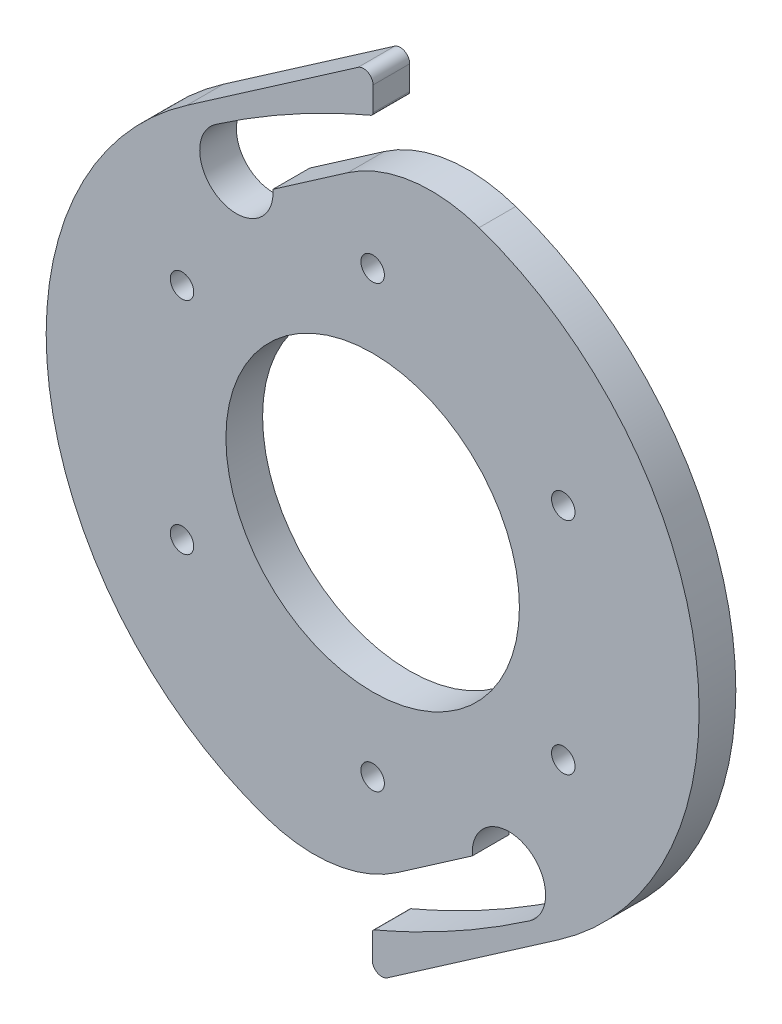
ISO-10303-21;
HEADER;
FILE_DESCRIPTION(('STEP AP214'),'2;1');
FILE_NAME('part.step','',(''),(''),'','','');
FILE_SCHEMA(('AUTOMOTIVE_DESIGN { 1 0 10303 214 1 1 1 1 }'));
ENDSEC;
DATA;
#1=APPLICATION_CONTEXT('core data for automotive mechanical design processes');
#2=APPLICATION_PROTOCOL_DEFINITION('international standard','automotive_design',2000,#1);
#3=PRODUCT_CONTEXT('',#1,'mechanical');
#4=PRODUCT('Part','Part','',(#3));
#5=PRODUCT_RELATED_PRODUCT_CATEGORY('part','',(#4));
#6=PRODUCT_DEFINITION_FORMATION('','',#4);
#7=PRODUCT_DEFINITION_CONTEXT('part definition',#1,'design');
#8=PRODUCT_DEFINITION('design','',#6,#7);
#9=PRODUCT_DEFINITION_SHAPE('','',#8);
#10=(LENGTH_UNIT() NAMED_UNIT(*) SI_UNIT(.MILLI.,.METRE.));
#11=(NAMED_UNIT(*) PLANE_ANGLE_UNIT() SI_UNIT($,.RADIAN.));
#12=(NAMED_UNIT(*) SI_UNIT($,.STERADIAN.) SOLID_ANGLE_UNIT());
#13=UNCERTAINTY_MEASURE_WITH_UNIT(LENGTH_MEASURE(1.E-05),#10,'distance_accuracy_value','');
#14=(GEOMETRIC_REPRESENTATION_CONTEXT(3) GLOBAL_UNCERTAINTY_ASSIGNED_CONTEXT((#13)) GLOBAL_UNIT_ASSIGNED_CONTEXT((#10,
#11,#12)) REPRESENTATION_CONTEXT('',''));
#15=CARTESIAN_POINT('',(0.,0.,0.));
#16=DIRECTION('',(0.,0.,1.));
#17=DIRECTION('',(1.,0.,0.));
#18=AXIS2_PLACEMENT_3D('',#15,#16,#17);
#19=CARTESIAN_POINT('',(-0.449022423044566,48.4008289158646,5.));
#20=DIRECTION('',(0.,0.,-1.));
#21=DIRECTION('',(-1.,0.,0.));
#22=AXIS2_PLACEMENT_3D('',#19,#20,#21);
#23=PLANE('',#22);
#24=CARTESIAN_POINT('',(-25.9807621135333,-14.9999999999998,5.));
#25=DIRECTION('',(0.,0.,1.));
#26=DIRECTION('',(1.,0.,0.));
#27=AXIS2_PLACEMENT_3D('',#24,#25,#26);
#28=CIRCLE('',#27,1.6);
#29=CARTESIAN_POINT('',(-24.3807621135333,-14.9999999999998,5.));
#30=VERTEX_POINT('',#29);
#31=EDGE_CURVE('E350',#30,#30,#28,.T.);
#32=ORIENTED_EDGE('',*,*,#31,.F.);
#33=EDGE_LOOP('',(#32));
#34=FACE_BOUND('',#33,.T.);
#35=CARTESIAN_POINT('',(25.9807621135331,-15.0000000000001,5.));
#36=DIRECTION('',(0.,0.,1.));
#37=DIRECTION('',(1.,0.,0.));
#38=AXIS2_PLACEMENT_3D('',#35,#36,#37);
#39=CIRCLE('',#38,1.6);
#40=CARTESIAN_POINT('',(27.5807621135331,-15.0000000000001,5.));
#41=VERTEX_POINT('',#40);
#42=EDGE_CURVE('E362',#41,#41,#39,.T.);
#43=ORIENTED_EDGE('',*,*,#42,.F.);
#44=EDGE_LOOP('',(#43));
#45=FACE_BOUND('',#44,.T.);
#46=CARTESIAN_POINT('',(0.,30.,5.));
#47=DIRECTION('',(0.,0.,1.));
#48=DIRECTION('',(1.,0.,0.));
#49=AXIS2_PLACEMENT_3D('',#46,#47,#48);
#50=CIRCLE('',#49,1.6);
#51=CARTESIAN_POINT('',(1.6,30.,5.));
#52=VERTEX_POINT('',#51);
#53=EDGE_CURVE('E374',#52,#52,#50,.T.);
#54=ORIENTED_EDGE('',*,*,#53,.F.);
#55=EDGE_LOOP('',(#54));
#56=FACE_BOUND('',#55,.T.);
#57=CARTESIAN_POINT('',(-0.449022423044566,48.4008289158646,5.));
#58=DIRECTION('',(0.,0.,-1.));
#59=DIRECTION('',(-1.,0.,0.));
#60=AXIS2_PLACEMENT_3D('',#57,#58,#59);
#61=CIRCLE('',#60,0.499999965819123);
#62=CARTESIAN_POINT('',(0.0509775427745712,48.4008289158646,5.));
#63=VERTEX_POINT('',#62);
#64=CARTESIAN_POINT('',(-0.25283719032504,47.9409253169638,5.));
#65=VERTEX_POINT('',#64);
#66=EDGE_CURVE('E251',#63,#65,#61,.T.);
#67=ORIENTED_EDGE('',*,*,#66,.F.);
#68=DIRECTION('',(0.,-1.,0.));
#69=VECTOR('',#68,1.);
#70=CARTESIAN_POINT('',(0.0509775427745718,51.670234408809,5.));
#71=LINE('',#70,#69);
#72=CARTESIAN_POINT('',(0.0509775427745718,51.670234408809,5.));
#73=VERTEX_POINT('',#72);
#74=EDGE_CURVE('E175',#73,#63,#71,.T.);
#75=ORIENTED_EDGE('',*,*,#74,.F.);
#76=CARTESIAN_POINT('',(-1.24902245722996,51.6702344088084,5.));
#77=DIRECTION('',(0.,0.,1.));
#78=DIRECTION('',(1.,0.,0.));
#79=AXIS2_PLACEMENT_3D('',#76,#77,#78);
#80=CIRCLE('',#79,1.30000000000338);
#81=CARTESIAN_POINT('',(-1.98902706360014,52.739062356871,5.));
#82=VERTEX_POINT('',#81);
#83=EDGE_CURVE('E170',#73,#82,#80,.T.);
#84=ORIENTED_EDGE('',*,*,#83,.T.);
#85=DIRECTION('',(0.822175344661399,0.569234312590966,0.));
#86=VECTOR('',#85,1.);
#87=CARTESIAN_POINT('',(-25.3269304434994,36.5810305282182,5.));
#88=LINE('',#87,#86);
#89=CARTESIAN_POINT('',(-25.3269304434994,36.5810305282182,5.));
#90=VERTEX_POINT('',#89);
#91=EDGE_CURVE('E174',#90,#82,#88,.T.);
#92=ORIENTED_EDGE('',*,*,#91,.F.);
#93=CARTESIAN_POINT('',(0.,0.,5.));
#94=DIRECTION('',(0.,0.,1.));
#95=DIRECTION('',(1.,0.,0.));
#96=AXIS2_PLACEMENT_3D('',#93,#94,#95);
#97=CIRCLE('',#96,44.4929792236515);
#98=CARTESIAN_POINT('',(-14.5031246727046,-42.0628645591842,5.));
#99=VERTEX_POINT('',#98);
#100=EDGE_CURVE('E187',#90,#99,#97,.T.);
#101=ORIENTED_EDGE('',*,*,#100,.T.);
#102=CARTESIAN_POINT('',(-7.98383784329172,-23.1552232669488,5.));
#103=DIRECTION('',(0.,0.,1.));
#104=DIRECTION('',(1.,0.,0.));
#105=AXIS2_PLACEMENT_3D('',#102,#103,#104);
#106=CIRCLE('',#105,20.);
#107=CARTESIAN_POINT('',(3.40084840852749,-39.5987301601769,5.));
#108=VERTEX_POINT('',#107);
#109=EDGE_CURVE('E189',#99,#108,#106,.T.);
#110=ORIENTED_EDGE('',*,*,#109,.T.);
#111=DIRECTION('',(0.822175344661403,0.56923431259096,0.));
#112=VECTOR('',#111,1.);
#113=CARTESIAN_POINT('',(3.4008484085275,-39.5987301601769,5.));
#114=LINE('',#113,#112);
#115=CARTESIAN_POINT('',(13.5809367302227,-32.5505309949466,5.));
#116=VERTEX_POINT('',#115);
#117=EDGE_CURVE('E449',#108,#116,#114,.T.);
#118=ORIENTED_EDGE('',*,*,#117,.T.);
#119=CARTESIAN_POINT('',(18.5670774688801,-32.1785087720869,5.));
#120=DIRECTION('',(0.,0.,1.));
#121=DIRECTION('',(1.,0.,0.));
#122=AXIS2_PLACEMENT_3D('',#119,#120,#121);
#123=CIRCLE('',#122,5.);
#124=CARTESIAN_POINT('',(21.4132490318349,-36.289385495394,5.));
#125=VERTEX_POINT('',#124);
#126=EDGE_CURVE('E441',#125,#116,#123,.T.);
#127=ORIENTED_EDGE('',*,*,#126,.F.);
#128=CARTESIAN_POINT('',(21.4132490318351,-36.2893854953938,5.));
#129=CARTESIAN_POINT('',(14.7027815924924,-40.9018978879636,5.));
#130=CARTESIAN_POINT('',(7.64931093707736,-44.7857446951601,5.));
#131=CARTESIAN_POINT('',(0.252837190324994,-47.9409253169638,5.));
#132=B_SPLINE_CURVE_WITH_KNOTS('',3,(#128,#129,#130,#131),.UNSPECIFIED.,.F.,.F.,(4,4),(0.,
0.807146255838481),.UNSPECIFIED.);
#133=CARTESIAN_POINT('',(0.252837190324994,-47.9409253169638,5.));
#134=VERTEX_POINT('',#133);
#135=EDGE_CURVE('E435',#125,#134,#132,.T.);
#136=ORIENTED_EDGE('',*,*,#135,.T.);
#137=CARTESIAN_POINT('',(0.449022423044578,-48.4008289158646,5.));
#138=DIRECTION('',(0.,0.,-1.));
#139=DIRECTION('',(-1.,0.,0.));
#140=AXIS2_PLACEMENT_3D('',#137,#138,#139);
#141=CIRCLE('',#140,0.499999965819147);
#142=CARTESIAN_POINT('',(-0.0509775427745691,-48.4008289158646,5.));
#143=VERTEX_POINT('',#142);
#144=EDGE_CURVE('E442',#143,#134,#141,.T.);
#145=ORIENTED_EDGE('',*,*,#144,.F.);
#146=DIRECTION('',(1.0677768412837E-13,1.,0.));
#147=VECTOR('',#146,1.);
#148=CARTESIAN_POINT('',(-0.0509775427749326,-51.670234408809,5.));
#149=LINE('',#148,#147);
#150=CARTESIAN_POINT('',(-0.0509775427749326,-51.670234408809,5.));
#151=VERTEX_POINT('',#150);
#152=EDGE_CURVE('E472',#151,#143,#149,.T.);
#153=ORIENTED_EDGE('',*,*,#152,.F.);
#154=CARTESIAN_POINT('',(1.2490224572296,-51.6702344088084,5.));
#155=DIRECTION('',(0.,0.,1.));
#156=DIRECTION('',(1.,0.,0.));
#157=AXIS2_PLACEMENT_3D('',#154,#155,#156);
#158=CIRCLE('',#157,1.30000000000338);
#159=CARTESIAN_POINT('',(1.98902706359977,-52.739062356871,5.));
#160=VERTEX_POINT('',#159);
#161=EDGE_CURVE('E473',#151,#160,#158,.T.);
#162=ORIENTED_EDGE('',*,*,#161,.T.);
#163=DIRECTION('',(-0.822175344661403,-0.56923431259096,0.));
#164=VECTOR('',#163,1.);
#165=CARTESIAN_POINT('',(25.3269304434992,-36.5810305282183,5.));
#166=LINE('',#165,#164);
#167=CARTESIAN_POINT('',(25.3269304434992,-36.5810305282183,5.));
#168=VERTEX_POINT('',#167);
#169=EDGE_CURVE('E474',#168,#160,#166,.T.);
#170=ORIENTED_EDGE('',*,*,#169,.F.);
#171=CARTESIAN_POINT('',(0.,0.,5.));
#172=DIRECTION('',(0.,0.,1.));
#173=DIRECTION('',(1.,0.,0.));
#174=AXIS2_PLACEMENT_3D('',#171,#172,#173);
#175=CIRCLE('',#174,44.4929792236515);
#176=CARTESIAN_POINT('',(14.5031246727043,42.0628645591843,5.));
#177=VERTEX_POINT('',#176);
#178=EDGE_CURVE('E479',#168,#177,#175,.T.);
#179=ORIENTED_EDGE('',*,*,#178,.T.);
#180=CARTESIAN_POINT('',(7.98383784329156,23.1552232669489,5.));
#181=DIRECTION('',(0.,0.,1.));
#182=DIRECTION('',(1.,0.,0.));
#183=AXIS2_PLACEMENT_3D('',#180,#181,#182);
#184=CIRCLE('',#183,20.);
#185=CARTESIAN_POINT('',(-3.40084840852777,39.5987301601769,5.));
#186=VERTEX_POINT('',#185);
#187=EDGE_CURVE('E481',#177,#186,#184,.T.);
#188=ORIENTED_EDGE('',*,*,#187,.T.);
#189=DIRECTION('',(-0.822175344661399,-0.569234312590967,0.));
#190=VECTOR('',#189,1.);
#191=CARTESIAN_POINT('',(-3.40084840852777,39.5987301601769,5.));
#192=LINE('',#191,#190);
#193=CARTESIAN_POINT('',(-13.5809367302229,32.5505309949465,5.));
#194=VERTEX_POINT('',#193);
#195=EDGE_CURVE('E482',#186,#194,#192,.T.);
#196=ORIENTED_EDGE('',*,*,#195,.T.);
#197=CARTESIAN_POINT('',(-18.5670774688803,32.1785087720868,5.));
#198=DIRECTION('',(0.,0.,1.));
#199=DIRECTION('',(1.,0.,0.));
#200=AXIS2_PLACEMENT_3D('',#197,#198,#199);
#201=CIRCLE('',#200,5.);
#202=CARTESIAN_POINT('',(-21.4132490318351,36.2893854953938,5.));
#203=VERTEX_POINT('',#202);
#204=EDGE_CURVE('E389',#203,#194,#201,.T.);
#205=ORIENTED_EDGE('',*,*,#204,.F.);
#206=CARTESIAN_POINT('',(-21.4132490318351,36.2893854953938,5.));
#207=CARTESIAN_POINT('',(-14.7027815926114,40.9018978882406,5.));
#208=CARTESIAN_POINT('',(-7.64931093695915,44.7857446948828,5.));
#209=CARTESIAN_POINT('',(-0.25283719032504,47.9409253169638,5.));
#210=B_SPLINE_CURVE_WITH_KNOTS('',3,(#206,#207,#208,#209),.UNSPECIFIED.,.F.,.F.,(4,4),(0.,
0.807146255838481),.UNSPECIFIED.);
#211=EDGE_CURVE('E124',#203,#65,#210,.T.);
#212=ORIENTED_EDGE('',*,*,#211,.T.);
#213=EDGE_LOOP('',(#67,#75,#84,#92,#101,#110,#118,#127,#136,#145,#153,#162,#170,#179,#188,#196,
#205,#212));
#214=FACE_BOUND('',#213,.T.);
#215=CARTESIAN_POINT('',(0.,0.,5.));
#216=DIRECTION('',(0.,0.,1.));
#217=DIRECTION('',(1.,0.,0.));
#218=AXIS2_PLACEMENT_3D('',#215,#216,#217);
#219=CIRCLE('',#218,20.);
#220=CARTESIAN_POINT('',(20.,0.,5.));
#221=VERTEX_POINT('',#220);
#222=EDGE_CURVE('E198',#221,#221,#219,.T.);
#223=ORIENTED_EDGE('',*,*,#222,.F.);
#224=EDGE_LOOP('',(#223));
#225=FACE_BOUND('',#224,.T.);
#226=CARTESIAN_POINT('',(25.9807621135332,14.9999999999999,5.));
#227=DIRECTION('',(0.,0.,1.));
#228=DIRECTION('',(1.,0.,0.));
#229=AXIS2_PLACEMENT_3D('',#226,#227,#228);
#230=CIRCLE('',#229,1.6);
#231=CARTESIAN_POINT('',(27.5807621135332,14.9999999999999,5.));
#232=VERTEX_POINT('',#231);
#233=EDGE_CURVE('E368',#232,#232,#230,.T.);
#234=ORIENTED_EDGE('',*,*,#233,.F.);
#235=EDGE_LOOP('',(#234));
#236=FACE_BOUND('',#235,.T.);
#237=CARTESIAN_POINT('',(-2.09489001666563E-13,-30.,5.));
#238=DIRECTION('',(0.,0.,1.));
#239=DIRECTION('',(1.,0.,0.));
#240=AXIS2_PLACEMENT_3D('',#237,#238,#239);
#241=CIRCLE('',#240,1.6);
#242=CARTESIAN_POINT('',(1.59999999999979,-30.,5.));
#243=VERTEX_POINT('',#242);
#244=EDGE_CURVE('E356',#243,#243,#241,.T.);
#245=ORIENTED_EDGE('',*,*,#244,.F.);
#246=EDGE_LOOP('',(#245));
#247=FACE_BOUND('',#246,.T.);
#248=CARTESIAN_POINT('',(-25.980762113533,15.0000000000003,5.));
#249=DIRECTION('',(0.,0.,1.));
#250=DIRECTION('',(1.,0.,0.));
#251=AXIS2_PLACEMENT_3D('',#248,#249,#250);
#252=CIRCLE('',#251,1.6);
#253=CARTESIAN_POINT('',(-24.380762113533,15.0000000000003,5.));
#254=VERTEX_POINT('',#253);
#255=EDGE_CURVE('E341',#254,#254,#252,.T.);
#256=ORIENTED_EDGE('',*,*,#255,.F.);
#257=EDGE_LOOP('',(#256));
#258=FACE_BOUND('',#257,.T.);
#259=ADVANCED_FACE('F37',(#34,#45,#56,#214,#225,#236,#247,#258),#23,.F.);
#260=CARTESIAN_POINT('',(-0.449022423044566,48.4008289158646,0.));
#261=DIRECTION('',(0.,0.,-1.));
#262=DIRECTION('',(-1.,0.,0.));
#263=AXIS2_PLACEMENT_3D('',#260,#261,#262);
#264=PLANE('',#263);
#265=CARTESIAN_POINT('',(-25.9807621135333,-14.9999999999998,0.));
#266=DIRECTION('',(0.,0.,1.));
#267=DIRECTION('',(1.,0.,0.));
#268=AXIS2_PLACEMENT_3D('',#265,#266,#267);
#269=CIRCLE('',#268,1.6);
#270=CARTESIAN_POINT('',(-24.3807621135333,-14.9999999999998,0.));
#271=VERTEX_POINT('',#270);
#272=EDGE_CURVE('E347',#271,#271,#269,.T.);
#273=ORIENTED_EDGE('',*,*,#272,.T.);
#274=EDGE_LOOP('',(#273));
#275=FACE_BOUND('',#274,.T.);
#276=CARTESIAN_POINT('',(25.9807621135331,-15.0000000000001,0.));
#277=DIRECTION('',(0.,0.,1.));
#278=DIRECTION('',(1.,0.,0.));
#279=AXIS2_PLACEMENT_3D('',#276,#277,#278);
#280=CIRCLE('',#279,1.6);
#281=CARTESIAN_POINT('',(27.5807621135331,-15.0000000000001,0.));
#282=VERTEX_POINT('',#281);
#283=EDGE_CURVE('E359',#282,#282,#280,.T.);
#284=ORIENTED_EDGE('',*,*,#283,.T.);
#285=EDGE_LOOP('',(#284));
#286=FACE_BOUND('',#285,.T.);
#287=CARTESIAN_POINT('',(0.,30.,0.));
#288=DIRECTION('',(0.,0.,1.));
#289=DIRECTION('',(1.,0.,0.));
#290=AXIS2_PLACEMENT_3D('',#287,#288,#289);
#291=CIRCLE('',#290,1.6);
#292=CARTESIAN_POINT('',(1.6,30.,0.));
#293=VERTEX_POINT('',#292);
#294=EDGE_CURVE('E371',#293,#293,#291,.T.);
#295=ORIENTED_EDGE('',*,*,#294,.T.);
#296=EDGE_LOOP('',(#295));
#297=FACE_BOUND('',#296,.T.);
#298=CARTESIAN_POINT('',(-0.449022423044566,48.4008289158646,0.));
#299=DIRECTION('',(0.,0.,-1.));
#300=DIRECTION('',(-1.,0.,0.));
#301=AXIS2_PLACEMENT_3D('',#298,#299,#300);
#302=CIRCLE('',#301,0.499999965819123);
#303=CARTESIAN_POINT('',(0.0509775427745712,48.4008289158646,0.));
#304=VERTEX_POINT('',#303);
#305=CARTESIAN_POINT('',(-0.25283719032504,47.9409253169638,0.));
#306=VERTEX_POINT('',#305);
#307=EDGE_CURVE('E194',#304,#306,#302,.T.);
#308=ORIENTED_EDGE('',*,*,#307,.T.);
#309=CARTESIAN_POINT('',(-21.4132490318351,36.2893854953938,0.));
#310=CARTESIAN_POINT('',(-14.7027815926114,40.9018978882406,0.));
#311=CARTESIAN_POINT('',(-7.64931093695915,44.7857446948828,0.));
#312=CARTESIAN_POINT('',(-0.25283719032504,47.9409253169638,0.));
#313=B_SPLINE_CURVE_WITH_KNOTS('',3,(#309,#310,#311,#312),.UNSPECIFIED.,.F.,.F.,(4,4),(0.,
0.807146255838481),.UNSPECIFIED.);
#314=CARTESIAN_POINT('',(-21.4132490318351,36.2893854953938,0.));
#315=VERTEX_POINT('',#314);
#316=EDGE_CURVE('E197',#315,#306,#313,.T.);
#317=ORIENTED_EDGE('',*,*,#316,.F.);
#318=CARTESIAN_POINT('',(-18.5670774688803,32.1785087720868,0.));
#319=DIRECTION('',(0.,0.,1.));
#320=DIRECTION('',(1.,0.,0.));
#321=AXIS2_PLACEMENT_3D('',#318,#319,#320);
#322=CIRCLE('',#321,5.);
#323=CARTESIAN_POINT('',(-13.5809367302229,32.5505309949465,0.));
#324=VERTEX_POINT('',#323);
#325=EDGE_CURVE('E203',#315,#324,#322,.T.);
#326=ORIENTED_EDGE('',*,*,#325,.T.);
#327=DIRECTION('',(-0.822175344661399,-0.569234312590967,0.));
#328=VECTOR('',#327,1.);
#329=CARTESIAN_POINT('',(-3.40084840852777,39.5987301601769,0.));
#330=LINE('',#329,#328);
#331=CARTESIAN_POINT('',(-3.40084840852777,39.5987301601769,0.));
#332=VERTEX_POINT('',#331);
#333=EDGE_CURVE('E209',#332,#324,#330,.T.);
#334=ORIENTED_EDGE('',*,*,#333,.F.);
#335=CARTESIAN_POINT('',(7.98383784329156,23.1552232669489,0.));
#336=DIRECTION('',(0.,0.,1.));
#337=DIRECTION('',(1.,0.,0.));
#338=AXIS2_PLACEMENT_3D('',#335,#336,#337);
#339=CIRCLE('',#338,20.);
#340=CARTESIAN_POINT('',(14.5031246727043,42.0628645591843,0.));
#341=VERTEX_POINT('',#340);
#342=EDGE_CURVE('E212',#341,#332,#339,.T.);
#343=ORIENTED_EDGE('',*,*,#342,.F.);
#344=CARTESIAN_POINT('',(0.,0.,0.));
#345=DIRECTION('',(0.,0.,1.));
#346=DIRECTION('',(1.,0.,0.));
#347=AXIS2_PLACEMENT_3D('',#344,#345,#346);
#348=CIRCLE('',#347,44.4929792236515);
#349=CARTESIAN_POINT('',(25.3269304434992,-36.5810305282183,0.));
#350=VERTEX_POINT('',#349);
#351=EDGE_CURVE('E214',#350,#341,#348,.T.);
#352=ORIENTED_EDGE('',*,*,#351,.F.);
#353=DIRECTION('',(-0.822175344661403,-0.56923431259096,0.));
#354=VECTOR('',#353,1.);
#355=CARTESIAN_POINT('',(25.3269304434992,-36.5810305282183,0.));
#356=LINE('',#355,#354);
#357=CARTESIAN_POINT('',(1.98902706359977,-52.739062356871,0.));
#358=VERTEX_POINT('',#357);
#359=EDGE_CURVE('E216',#350,#358,#356,.T.);
#360=ORIENTED_EDGE('',*,*,#359,.T.);
#361=CARTESIAN_POINT('',(1.2490224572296,-51.6702344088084,0.));
#362=DIRECTION('',(0.,0.,1.));
#363=DIRECTION('',(1.,0.,0.));
#364=AXIS2_PLACEMENT_3D('',#361,#362,#363);
#365=CIRCLE('',#364,1.30000000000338);
#366=CARTESIAN_POINT('',(-0.0509775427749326,-51.670234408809,0.));
#367=VERTEX_POINT('',#366);
#368=EDGE_CURVE('E219',#367,#358,#365,.T.);
#369=ORIENTED_EDGE('',*,*,#368,.F.);
#370=DIRECTION('',(1.0677768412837E-13,1.,0.));
#371=VECTOR('',#370,1.);
#372=CARTESIAN_POINT('',(-0.0509775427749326,-51.670234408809,0.));
#373=LINE('',#372,#371);
#374=CARTESIAN_POINT('',(-0.0509775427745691,-48.4008289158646,0.));
#375=VERTEX_POINT('',#374);
#376=EDGE_CURVE('E222',#367,#375,#373,.T.);
#377=ORIENTED_EDGE('',*,*,#376,.T.);
#378=CARTESIAN_POINT('',(0.449022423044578,-48.4008289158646,0.));
#379=DIRECTION('',(0.,0.,-1.));
#380=DIRECTION('',(-1.,0.,0.));
#381=AXIS2_PLACEMENT_3D('',#378,#379,#380);
#382=CIRCLE('',#381,0.499999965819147);
#383=CARTESIAN_POINT('',(0.252837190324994,-47.9409253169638,0.));
#384=VERTEX_POINT('',#383);
#385=EDGE_CURVE('E225',#375,#384,#382,.T.);
#386=ORIENTED_EDGE('',*,*,#385,.T.);
#387=CARTESIAN_POINT('',(21.4132490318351,-36.2893854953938,0.));
#388=CARTESIAN_POINT('',(14.7027815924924,-40.9018978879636,0.));
#389=CARTESIAN_POINT('',(7.64931093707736,-44.7857446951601,0.));
#390=CARTESIAN_POINT('',(0.252837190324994,-47.9409253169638,0.));
#391=B_SPLINE_CURVE_WITH_KNOTS('',3,(#387,#388,#389,#390),.UNSPECIFIED.,.F.,.F.,(4,4),(0.,
0.807146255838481),.UNSPECIFIED.);
#392=CARTESIAN_POINT('',(21.4132490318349,-36.289385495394,0.));
#393=VERTEX_POINT('',#392);
#394=EDGE_CURVE('E228',#393,#384,#391,.T.);
#395=ORIENTED_EDGE('',*,*,#394,.F.);
#396=CARTESIAN_POINT('',(18.5670774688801,-32.1785087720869,0.));
#397=DIRECTION('',(0.,0.,1.));
#398=DIRECTION('',(1.,0.,0.));
#399=AXIS2_PLACEMENT_3D('',#396,#397,#398);
#400=CIRCLE('',#399,5.);
#401=CARTESIAN_POINT('',(13.5809367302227,-32.5505309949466,0.));
#402=VERTEX_POINT('',#401);
#403=EDGE_CURVE('E233',#393,#402,#400,.T.);
#404=ORIENTED_EDGE('',*,*,#403,.T.);
#405=DIRECTION('',(0.822175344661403,0.56923431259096,0.));
#406=VECTOR('',#405,1.);
#407=CARTESIAN_POINT('',(3.4008484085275,-39.5987301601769,0.));
#408=LINE('',#407,#406);
#409=CARTESIAN_POINT('',(3.40084840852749,-39.5987301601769,0.));
#410=VERTEX_POINT('',#409);
#411=EDGE_CURVE('E239',#410,#402,#408,.T.);
#412=ORIENTED_EDGE('',*,*,#411,.F.);
#413=CARTESIAN_POINT('',(-7.98383784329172,-23.1552232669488,0.));
#414=DIRECTION('',(0.,0.,1.));
#415=DIRECTION('',(1.,0.,0.));
#416=AXIS2_PLACEMENT_3D('',#413,#414,#415);
#417=CIRCLE('',#416,20.);
#418=CARTESIAN_POINT('',(-14.5031246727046,-42.0628645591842,0.));
#419=VERTEX_POINT('',#418);
#420=EDGE_CURVE('E242',#419,#410,#417,.T.);
#421=ORIENTED_EDGE('',*,*,#420,.F.);
#422=CARTESIAN_POINT('',(0.,0.,0.));
#423=DIRECTION('',(0.,0.,1.));
#424=DIRECTION('',(1.,0.,0.));
#425=AXIS2_PLACEMENT_3D('',#422,#423,#424);
#426=CIRCLE('',#425,44.4929792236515);
#427=CARTESIAN_POINT('',(-25.3269304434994,36.5810305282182,0.));
#428=VERTEX_POINT('',#427);
#429=EDGE_CURVE('E244',#428,#419,#426,.T.);
#430=ORIENTED_EDGE('',*,*,#429,.F.);
#431=DIRECTION('',(0.822175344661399,0.569234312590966,0.));
#432=VECTOR('',#431,1.);
#433=CARTESIAN_POINT('',(-25.3269304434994,36.5810305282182,0.));
#434=LINE('',#433,#432);
#435=CARTESIAN_POINT('',(-1.98902706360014,52.739062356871,0.));
#436=VERTEX_POINT('',#435);
#437=EDGE_CURVE('E246',#428,#436,#434,.T.);
#438=ORIENTED_EDGE('',*,*,#437,.T.);
#439=CARTESIAN_POINT('',(-1.24902245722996,51.6702344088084,0.));
#440=DIRECTION('',(0.,0.,1.));
#441=DIRECTION('',(1.,0.,0.));
#442=AXIS2_PLACEMENT_3D('',#439,#440,#441);
#443=CIRCLE('',#442,1.30000000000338);
#444=CARTESIAN_POINT('',(0.0509775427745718,51.670234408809,0.));
#445=VERTEX_POINT('',#444);
#446=EDGE_CURVE('E179',#445,#436,#443,.T.);
#447=ORIENTED_EDGE('',*,*,#446,.F.);
#448=DIRECTION('',(0.,-1.,0.));
#449=VECTOR('',#448,1.);
#450=CARTESIAN_POINT('',(0.0509775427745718,51.670234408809,0.));
#451=LINE('',#450,#449);
#452=EDGE_CURVE('E249',#445,#304,#451,.T.);
#453=ORIENTED_EDGE('',*,*,#452,.T.);
#454=EDGE_LOOP('',(#308,#317,#326,#334,#343,#352,#360,#369,#377,#386,#395,#404,#412,#421,#430,
#438,#447,#453));
#455=FACE_BOUND('',#454,.T.);
#456=CARTESIAN_POINT('',(0.,0.,0.));
#457=DIRECTION('',(0.,0.,1.));
#458=DIRECTION('',(1.,0.,0.));
#459=AXIS2_PLACEMENT_3D('',#456,#457,#458);
#460=CIRCLE('',#459,20.);
#461=CARTESIAN_POINT('',(20.,0.,0.));
#462=VERTEX_POINT('',#461);
#463=EDGE_CURVE('E377',#462,#462,#460,.T.);
#464=ORIENTED_EDGE('',*,*,#463,.T.);
#465=EDGE_LOOP('',(#464));
#466=FACE_BOUND('',#465,.T.);
#467=CARTESIAN_POINT('',(25.9807621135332,14.9999999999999,0.));
#468=DIRECTION('',(0.,0.,1.));
#469=DIRECTION('',(1.,0.,0.));
#470=AXIS2_PLACEMENT_3D('',#467,#468,#469);
#471=CIRCLE('',#470,1.6);
#472=CARTESIAN_POINT('',(27.5807621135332,14.9999999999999,0.));
#473=VERTEX_POINT('',#472);
#474=EDGE_CURVE('E365',#473,#473,#471,.T.);
#475=ORIENTED_EDGE('',*,*,#474,.T.);
#476=EDGE_LOOP('',(#475));
#477=FACE_BOUND('',#476,.T.);
#478=CARTESIAN_POINT('',(-2.09489001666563E-13,-30.,0.));
#479=DIRECTION('',(0.,0.,1.));
#480=DIRECTION('',(1.,0.,0.));
#481=AXIS2_PLACEMENT_3D('',#478,#479,#480);
#482=CIRCLE('',#481,1.6);
#483=CARTESIAN_POINT('',(1.59999999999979,-30.,0.));
#484=VERTEX_POINT('',#483);
#485=EDGE_CURVE('E353',#484,#484,#482,.T.);
#486=ORIENTED_EDGE('',*,*,#485,.T.);
#487=EDGE_LOOP('',(#486));
#488=FACE_BOUND('',#487,.T.);
#489=CARTESIAN_POINT('',(-25.980762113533,15.0000000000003,0.));
#490=DIRECTION('',(0.,0.,1.));
#491=DIRECTION('',(1.,0.,0.));
#492=AXIS2_PLACEMENT_3D('',#489,#490,#491);
#493=CIRCLE('',#492,1.6);
#494=CARTESIAN_POINT('',(-24.380762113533,15.0000000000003,0.));
#495=VERTEX_POINT('',#494);
#496=EDGE_CURVE('E344',#495,#495,#493,.T.);
#497=ORIENTED_EDGE('',*,*,#496,.T.);
#498=EDGE_LOOP('',(#497));
#499=FACE_BOUND('',#498,.T.);
#500=ADVANCED_FACE('F288',(#275,#286,#297,#455,#466,#477,#488,#499),#264,.T.);
#501=CARTESIAN_POINT('',(-0.449022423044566,48.4008289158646,5.));
#502=DIRECTION('',(0.,0.,-1.));
#503=DIRECTION('',(-1.,0.,0.));
#504=AXIS2_PLACEMENT_3D('',#501,#502,#503);
#505=CYLINDRICAL_SURFACE('',#504,0.499999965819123);
#506=ORIENTED_EDGE('',*,*,#307,.F.);
#507=DIRECTION('',(0.,0.,-1.));
#508=VECTOR('',#507,1.);
#509=CARTESIAN_POINT('',(0.0509775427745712,48.4008289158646,5.));
#510=LINE('',#509,#508);
#511=EDGE_CURVE('E11',#63,#304,#510,.T.);
#512=ORIENTED_EDGE('',*,*,#511,.F.);
#513=ORIENTED_EDGE('',*,*,#66,.T.);
#514=DIRECTION('',(0.,0.,-1.));
#515=VECTOR('',#514,1.);
#516=CARTESIAN_POINT('',(-0.25283719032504,47.9409253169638,5.));
#517=LINE('',#516,#515);
#518=EDGE_CURVE('E41',#65,#306,#517,.T.);
#519=ORIENTED_EDGE('',*,*,#518,.T.);
#520=EDGE_LOOP('',(#506,#512,#513,#519));
#521=FACE_BOUND('',#520,.T.);
#522=ADVANCED_FACE('F39',(#521),#505,.T.);
#523=CARTESIAN_POINT('',(0.0509775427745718,51.670234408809,5.));
#524=DIRECTION('',(1.,0.,0.));
#525=DIRECTION('',(0.,1.,0.));
#526=AXIS2_PLACEMENT_3D('',#523,#524,#525);
#527=PLANE('',#526);
#528=ORIENTED_EDGE('',*,*,#452,.F.);
#529=DIRECTION('',(0.,0.,-1.));
#530=VECTOR('',#529,1.);
#531=CARTESIAN_POINT('',(0.0509775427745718,51.670234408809,5.));
#532=LINE('',#531,#530);
#533=EDGE_CURVE('E47',#73,#445,#532,.T.);
#534=ORIENTED_EDGE('',*,*,#533,.F.);
#535=ORIENTED_EDGE('',*,*,#74,.T.);
#536=ORIENTED_EDGE('',*,*,#511,.T.);
#537=EDGE_LOOP('',(#528,#534,#535,#536));
#538=FACE_BOUND('',#537,.T.);
#539=ADVANCED_FACE('F290',(#538),#527,.T.);
#540=CARTESIAN_POINT('',(-1.24902245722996,51.6702344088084,5.));
#541=DIRECTION('',(0.,0.,-1.));
#542=DIRECTION('',(-1.,0.,0.));
#543=AXIS2_PLACEMENT_3D('',#540,#541,#542);
#544=CYLINDRICAL_SURFACE('',#543,1.30000000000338);
#545=ORIENTED_EDGE('',*,*,#446,.T.);
#546=DIRECTION('',(0.,0.,-1.));
#547=VECTOR('',#546,1.);
#548=CARTESIAN_POINT('',(-1.98902706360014,52.739062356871,5.));
#549=LINE('',#548,#547);
#550=EDGE_CURVE('E177',#82,#436,#549,.T.);
#551=ORIENTED_EDGE('',*,*,#550,.F.);
#552=ORIENTED_EDGE('',*,*,#83,.F.);
#553=ORIENTED_EDGE('',*,*,#533,.T.);
#554=EDGE_LOOP('',(#545,#551,#552,#553));
#555=FACE_BOUND('',#554,.T.);
#556=ADVANCED_FACE('F178',(#555),#544,.T.);
#557=CARTESIAN_POINT('',(-25.3269304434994,36.5810305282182,5.));
#558=DIRECTION('',(-0.569234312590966,0.822175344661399,0.));
#559=DIRECTION('',(-0.822175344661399,-0.569234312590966,0.));
#560=AXIS2_PLACEMENT_3D('',#557,#558,#559);
#561=PLANE('',#560);
#562=ORIENTED_EDGE('',*,*,#437,.F.);
#563=DIRECTION('',(0.,0.,-1.));
#564=VECTOR('',#563,1.);
#565=CARTESIAN_POINT('',(-25.3269304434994,36.5810305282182,5.));
#566=LINE('',#565,#564);
#567=EDGE_CURVE('E183',#90,#428,#566,.T.);
#568=ORIENTED_EDGE('',*,*,#567,.F.);
#569=ORIENTED_EDGE('',*,*,#91,.T.);
#570=ORIENTED_EDGE('',*,*,#550,.T.);
#571=EDGE_LOOP('',(#562,#568,#569,#570));
#572=FACE_BOUND('',#571,.T.);
#573=ADVANCED_FACE('F186',(#572),#561,.T.);
#574=CARTESIAN_POINT('',(0.,0.,5.));
#575=DIRECTION('',(0.,0.,-1.));
#576=DIRECTION('',(-1.,0.,0.));
#577=AXIS2_PLACEMENT_3D('',#574,#575,#576);
#578=CYLINDRICAL_SURFACE('',#577,44.4929792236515);
#579=ORIENTED_EDGE('',*,*,#429,.T.);
#580=DIRECTION('',(0.,0.,-1.));
#581=VECTOR('',#580,1.);
#582=CARTESIAN_POINT('',(-14.5031246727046,-42.0628645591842,5.));
#583=LINE('',#582,#581);
#584=EDGE_CURVE('E255',#99,#419,#583,.T.);
#585=ORIENTED_EDGE('',*,*,#584,.F.);
#586=ORIENTED_EDGE('',*,*,#100,.F.);
#587=ORIENTED_EDGE('',*,*,#567,.T.);
#588=EDGE_LOOP('',(#579,#585,#586,#587));
#589=FACE_BOUND('',#588,.T.);
#590=ADVANCED_FACE('F501',(#589),#578,.T.);
#591=CARTESIAN_POINT('',(-7.98383784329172,-23.1552232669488,5.));
#592=DIRECTION('',(0.,0.,-1.));
#593=DIRECTION('',(-1.,0.,0.));
#594=AXIS2_PLACEMENT_3D('',#591,#592,#593);
#595=CYLINDRICAL_SURFACE('',#594,20.);
#596=ORIENTED_EDGE('',*,*,#420,.T.);
#597=DIRECTION('',(0.,0.,-1.));
#598=VECTOR('',#597,1.);
#599=CARTESIAN_POINT('',(3.40084840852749,-39.5987301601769,5.));
#600=LINE('',#599,#598);
#601=EDGE_CURVE('E258',#108,#410,#600,.T.);
#602=ORIENTED_EDGE('',*,*,#601,.F.);
#603=ORIENTED_EDGE('',*,*,#109,.F.);
#604=ORIENTED_EDGE('',*,*,#584,.T.);
#605=EDGE_LOOP('',(#596,#602,#603,#604));
#606=FACE_BOUND('',#605,.T.);
#607=ADVANCED_FACE('F457',(#606),#595,.T.);
#608=CARTESIAN_POINT('',(3.4008484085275,-39.5987301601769,5.));
#609=DIRECTION('',(-0.56923431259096,0.822175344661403,0.));
#610=DIRECTION('',(-0.822175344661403,-0.56923431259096,0.));
#611=AXIS2_PLACEMENT_3D('',#608,#609,#610);
#612=PLANE('',#611);
#613=ORIENTED_EDGE('',*,*,#411,.T.);
#614=DIRECTION('',(0.,0.,-1.));
#615=VECTOR('',#614,1.);
#616=CARTESIAN_POINT('',(13.5809367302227,-32.5505309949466,5.));
#617=LINE('',#616,#615);
#618=EDGE_CURVE('E261',#116,#402,#617,.T.);
#619=ORIENTED_EDGE('',*,*,#618,.F.);
#620=ORIENTED_EDGE('',*,*,#117,.F.);
#621=ORIENTED_EDGE('',*,*,#601,.T.);
#622=EDGE_LOOP('',(#613,#619,#620,#621));
#623=FACE_BOUND('',#622,.T.);
#624=ADVANCED_FACE('F461',(#623),#612,.F.);
#625=CARTESIAN_POINT('',(18.5670774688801,-32.1785087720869,5.));
#626=DIRECTION('',(0.,0.,-1.));
#627=DIRECTION('',(-1.,0.,0.));
#628=AXIS2_PLACEMENT_3D('',#625,#626,#627);
#629=CYLINDRICAL_SURFACE('',#628,5.);
#630=ORIENTED_EDGE('',*,*,#403,.F.);
#631=DIRECTION('',(0.,0.,-1.));
#632=VECTOR('',#631,1.);
#633=CARTESIAN_POINT('',(21.4132490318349,-36.289385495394,5.));
#634=LINE('',#633,#632);
#635=EDGE_CURVE('E263',#125,#393,#634,.T.);
#636=ORIENTED_EDGE('',*,*,#635,.F.);
#637=ORIENTED_EDGE('',*,*,#126,.T.);
#638=ORIENTED_EDGE('',*,*,#618,.T.);
#639=EDGE_LOOP('',(#630,#636,#637,#638));
#640=FACE_BOUND('',#639,.T.);
#641=ADVANCED_FACE('F432',(#640),#629,.F.);
#642=DIRECTION('',(0.,0.,-1.));
#643=VECTOR('',#642,1.);
#644=SURFACE_OF_LINEAR_EXTRUSION('',#132,#643);
#645=ORIENTED_EDGE('',*,*,#394,.T.);
#646=DIRECTION('',(0.,0.,-1.));
#647=VECTOR('',#646,1.);
#648=CARTESIAN_POINT('',(0.252837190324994,-47.9409253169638,5.));
#649=LINE('',#648,#647);
#650=EDGE_CURVE('E265',#134,#384,#649,.T.);
#651=ORIENTED_EDGE('',*,*,#650,.F.);
#652=ORIENTED_EDGE('',*,*,#135,.F.);
#653=ORIENTED_EDGE('',*,*,#635,.T.);
#654=EDGE_LOOP('',(#645,#651,#652,#653));
#655=FACE_BOUND('',#654,.T.);
#656=ADVANCED_FACE('F427',(#655),#644,.F.);
#657=CARTESIAN_POINT('',(0.449022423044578,-48.4008289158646,5.));
#658=DIRECTION('',(0.,0.,-1.));
#659=DIRECTION('',(-1.,0.,0.));
#660=AXIS2_PLACEMENT_3D('',#657,#658,#659);
#661=CYLINDRICAL_SURFACE('',#660,0.499999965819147);
#662=ORIENTED_EDGE('',*,*,#385,.F.);
#663=DIRECTION('',(0.,0.,-1.));
#664=VECTOR('',#663,1.);
#665=CARTESIAN_POINT('',(-0.0509775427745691,-48.4008289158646,5.));
#666=LINE('',#665,#664);
#667=EDGE_CURVE('E267',#143,#375,#666,.T.);
#668=ORIENTED_EDGE('',*,*,#667,.F.);
#669=ORIENTED_EDGE('',*,*,#144,.T.);
#670=ORIENTED_EDGE('',*,*,#650,.T.);
#671=EDGE_LOOP('',(#662,#668,#669,#670));
#672=FACE_BOUND('',#671,.T.);
#673=ADVANCED_FACE('F423',(#672),#661,.T.);
#674=CARTESIAN_POINT('',(-0.0509775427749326,-51.670234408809,5.));
#675=DIRECTION('',(-1.,1.0677768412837E-13,0.));
#676=DIRECTION('',(-1.0677768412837E-13,-1.,0.));
#677=AXIS2_PLACEMENT_3D('',#674,#675,#676);
#678=PLANE('',#677);
#679=ORIENTED_EDGE('',*,*,#376,.F.);
#680=DIRECTION('',(0.,0.,-1.));
#681=VECTOR('',#680,1.);
#682=CARTESIAN_POINT('',(-0.0509775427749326,-51.670234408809,5.));
#683=LINE('',#682,#681);
#684=EDGE_CURVE('E269',#151,#367,#683,.T.);
#685=ORIENTED_EDGE('',*,*,#684,.F.);
#686=ORIENTED_EDGE('',*,*,#152,.T.);
#687=ORIENTED_EDGE('',*,*,#667,.T.);
#688=EDGE_LOOP('',(#679,#685,#686,#687));
#689=FACE_BOUND('',#688,.T.);
#690=ADVANCED_FACE('F419',(#689),#678,.T.);
#691=CARTESIAN_POINT('',(1.2490224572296,-51.6702344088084,5.));
#692=DIRECTION('',(0.,0.,-1.));
#693=DIRECTION('',(-1.,0.,0.));
#694=AXIS2_PLACEMENT_3D('',#691,#692,#693);
#695=CYLINDRICAL_SURFACE('',#694,1.30000000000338);
#696=ORIENTED_EDGE('',*,*,#368,.T.);
#697=DIRECTION('',(0.,0.,-1.));
#698=VECTOR('',#697,1.);
#699=CARTESIAN_POINT('',(1.98902706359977,-52.739062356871,5.));
#700=LINE('',#699,#698);
#701=EDGE_CURVE('E271',#160,#358,#700,.T.);
#702=ORIENTED_EDGE('',*,*,#701,.F.);
#703=ORIENTED_EDGE('',*,*,#161,.F.);
#704=ORIENTED_EDGE('',*,*,#684,.T.);
#705=EDGE_LOOP('',(#696,#702,#703,#704));
#706=FACE_BOUND('',#705,.T.);
#707=ADVANCED_FACE('F415',(#706),#695,.T.);
#708=CARTESIAN_POINT('',(25.3269304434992,-36.5810305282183,5.));
#709=DIRECTION('',(0.56923431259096,-0.822175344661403,0.));
#710=DIRECTION('',(0.822175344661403,0.56923431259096,0.));
#711=AXIS2_PLACEMENT_3D('',#708,#709,#710);
#712=PLANE('',#711);
#713=ORIENTED_EDGE('',*,*,#359,.F.);
#714=DIRECTION('',(0.,0.,-1.));
#715=VECTOR('',#714,1.);
#716=CARTESIAN_POINT('',(25.3269304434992,-36.5810305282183,5.));
#717=LINE('',#716,#715);
#718=EDGE_CURVE('E273',#168,#350,#717,.T.);
#719=ORIENTED_EDGE('',*,*,#718,.F.);
#720=ORIENTED_EDGE('',*,*,#169,.T.);
#721=ORIENTED_EDGE('',*,*,#701,.T.);
#722=EDGE_LOOP('',(#713,#719,#720,#721));
#723=FACE_BOUND('',#722,.T.);
#724=ADVANCED_FACE('F411',(#723),#712,.T.);
#725=CARTESIAN_POINT('',(0.,0.,5.));
#726=DIRECTION('',(0.,0.,-1.));
#727=DIRECTION('',(-1.,0.,0.));
#728=AXIS2_PLACEMENT_3D('',#725,#726,#727);
#729=CYLINDRICAL_SURFACE('',#728,44.4929792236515);
#730=ORIENTED_EDGE('',*,*,#351,.T.);
#731=DIRECTION('',(0.,0.,-1.));
#732=VECTOR('',#731,1.);
#733=CARTESIAN_POINT('',(14.5031246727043,42.0628645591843,5.));
#734=LINE('',#733,#732);
#735=EDGE_CURVE('E275',#177,#341,#734,.T.);
#736=ORIENTED_EDGE('',*,*,#735,.F.);
#737=ORIENTED_EDGE('',*,*,#178,.F.);
#738=ORIENTED_EDGE('',*,*,#718,.T.);
#739=EDGE_LOOP('',(#730,#736,#737,#738));
#740=FACE_BOUND('',#739,.T.);
#741=ADVANCED_FACE('F407',(#740),#729,.T.);
#742=CARTESIAN_POINT('',(7.98383784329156,23.1552232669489,5.));
#743=DIRECTION('',(0.,0.,-1.));
#744=DIRECTION('',(-1.,0.,0.));
#745=AXIS2_PLACEMENT_3D('',#742,#743,#744);
#746=CYLINDRICAL_SURFACE('',#745,20.);
#747=ORIENTED_EDGE('',*,*,#342,.T.);
#748=DIRECTION('',(0.,0.,-1.));
#749=VECTOR('',#748,1.);
#750=CARTESIAN_POINT('',(-3.40084840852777,39.5987301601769,5.));
#751=LINE('',#750,#749);
#752=EDGE_CURVE('E278',#186,#332,#751,.T.);
#753=ORIENTED_EDGE('',*,*,#752,.F.);
#754=ORIENTED_EDGE('',*,*,#187,.F.);
#755=ORIENTED_EDGE('',*,*,#735,.T.);
#756=EDGE_LOOP('',(#747,#753,#754,#755));
#757=FACE_BOUND('',#756,.T.);
#758=ADVANCED_FACE('F403',(#757),#746,.T.);
#759=CARTESIAN_POINT('',(-3.40084840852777,39.5987301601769,5.));
#760=DIRECTION('',(0.569234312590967,-0.822175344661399,0.));
#761=DIRECTION('',(0.822175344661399,0.569234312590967,0.));
#762=AXIS2_PLACEMENT_3D('',#759,#760,#761);
#763=PLANE('',#762);
#764=ORIENTED_EDGE('',*,*,#333,.T.);
#765=DIRECTION('',(0.,0.,-1.));
#766=VECTOR('',#765,1.);
#767=CARTESIAN_POINT('',(-13.5809367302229,32.5505309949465,5.));
#768=LINE('',#767,#766);
#769=EDGE_CURVE('E281',#194,#324,#768,.T.);
#770=ORIENTED_EDGE('',*,*,#769,.F.);
#771=ORIENTED_EDGE('',*,*,#195,.F.);
#772=ORIENTED_EDGE('',*,*,#752,.T.);
#773=EDGE_LOOP('',(#764,#770,#771,#772));
#774=FACE_BOUND('',#773,.T.);
#775=ADVANCED_FACE('F399',(#774),#763,.F.);
#776=CARTESIAN_POINT('',(-18.5670774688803,32.1785087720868,5.));
#777=DIRECTION('',(0.,0.,-1.));
#778=DIRECTION('',(-1.,0.,0.));
#779=AXIS2_PLACEMENT_3D('',#776,#777,#778);
#780=CYLINDRICAL_SURFACE('',#779,5.);
#781=ORIENTED_EDGE('',*,*,#325,.F.);
#782=DIRECTION('',(0.,0.,-1.));
#783=VECTOR('',#782,1.);
#784=CARTESIAN_POINT('',(-21.4132490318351,36.2893854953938,5.));
#785=LINE('',#784,#783);
#786=EDGE_CURVE('E282',#203,#315,#785,.T.);
#787=ORIENTED_EDGE('',*,*,#786,.F.);
#788=ORIENTED_EDGE('',*,*,#204,.T.);
#789=ORIENTED_EDGE('',*,*,#769,.T.);
#790=EDGE_LOOP('',(#781,#787,#788,#789));
#791=FACE_BOUND('',#790,.T.);
#792=ADVANCED_FACE('F396',(#791),#780,.F.);
#793=DIRECTION('',(0.,0.,-1.));
#794=VECTOR('',#793,1.);
#795=SURFACE_OF_LINEAR_EXTRUSION('',#210,#794);
#796=ORIENTED_EDGE('',*,*,#316,.T.);
#797=ORIENTED_EDGE('',*,*,#518,.F.);
#798=ORIENTED_EDGE('',*,*,#211,.F.);
#799=ORIENTED_EDGE('',*,*,#786,.T.);
#800=EDGE_LOOP('',(#796,#797,#798,#799));
#801=FACE_BOUND('',#800,.T.);
#802=ADVANCED_FACE('F285',(#801),#795,.F.);
#803=CARTESIAN_POINT('',(0.,0.,5.));
#804=DIRECTION('',(0.,0.,-1.));
#805=DIRECTION('',(-1.,0.,0.));
#806=AXIS2_PLACEMENT_3D('',#803,#804,#805);
#807=CYLINDRICAL_SURFACE('',#806,20.);
#808=ORIENTED_EDGE('',*,*,#222,.T.);
#809=EDGE_LOOP('',(#808));
#810=FACE_BOUND('',#809,.T.);
#811=ORIENTED_EDGE('',*,*,#463,.F.);
#812=EDGE_LOOP('',(#811));
#813=FACE_BOUND('',#812,.T.);
#814=ADVANCED_FACE('F309',(#810,#813),#807,.F.);
#815=CARTESIAN_POINT('',(0.,30.,5.));
#816=DIRECTION('',(0.,0.,-1.));
#817=DIRECTION('',(-1.,0.,0.));
#818=AXIS2_PLACEMENT_3D('',#815,#816,#817);
#819=CYLINDRICAL_SURFACE('',#818,1.6);
#820=ORIENTED_EDGE('',*,*,#53,.T.);
#821=EDGE_LOOP('',(#820));
#822=FACE_BOUND('',#821,.T.);
#823=ORIENTED_EDGE('',*,*,#294,.F.);
#824=EDGE_LOOP('',(#823));
#825=FACE_BOUND('',#824,.T.);
#826=ADVANCED_FACE('F312',(#822,#825),#819,.F.);
#827=CARTESIAN_POINT('',(25.9807621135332,14.9999999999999,5.));
#828=DIRECTION('',(0.,0.,-1.));
#829=DIRECTION('',(-1.,0.,0.));
#830=AXIS2_PLACEMENT_3D('',#827,#828,#829);
#831=CYLINDRICAL_SURFACE('',#830,1.6);
#832=ORIENTED_EDGE('',*,*,#233,.T.);
#833=EDGE_LOOP('',(#832));
#834=FACE_BOUND('',#833,.T.);
#835=ORIENTED_EDGE('',*,*,#474,.F.);
#836=EDGE_LOOP('',(#835));
#837=FACE_BOUND('',#836,.T.);
#838=ADVANCED_FACE('F316',(#834,#837),#831,.F.);
#839=CARTESIAN_POINT('',(25.9807621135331,-15.0000000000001,5.));
#840=DIRECTION('',(0.,0.,-1.));
#841=DIRECTION('',(-1.,0.,0.));
#842=AXIS2_PLACEMENT_3D('',#839,#840,#841);
#843=CYLINDRICAL_SURFACE('',#842,1.6);
#844=ORIENTED_EDGE('',*,*,#42,.T.);
#845=EDGE_LOOP('',(#844));
#846=FACE_BOUND('',#845,.T.);
#847=ORIENTED_EDGE('',*,*,#283,.F.);
#848=EDGE_LOOP('',(#847));
#849=FACE_BOUND('',#848,.T.);
#850=ADVANCED_FACE('F320',(#846,#849),#843,.F.);
#851=CARTESIAN_POINT('',(-2.09489001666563E-13,-30.,5.));
#852=DIRECTION('',(0.,0.,-1.));
#853=DIRECTION('',(-1.,0.,0.));
#854=AXIS2_PLACEMENT_3D('',#851,#852,#853);
#855=CYLINDRICAL_SURFACE('',#854,1.6);
#856=ORIENTED_EDGE('',*,*,#244,.T.);
#857=EDGE_LOOP('',(#856));
#858=FACE_BOUND('',#857,.T.);
#859=ORIENTED_EDGE('',*,*,#485,.F.);
#860=EDGE_LOOP('',(#859));
#861=FACE_BOUND('',#860,.T.);
#862=ADVANCED_FACE('F324',(#858,#861),#855,.F.);
#863=CARTESIAN_POINT('',(-25.9807621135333,-14.9999999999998,5.));
#864=DIRECTION('',(0.,0.,-1.));
#865=DIRECTION('',(-1.,0.,0.));
#866=AXIS2_PLACEMENT_3D('',#863,#864,#865);
#867=CYLINDRICAL_SURFACE('',#866,1.6);
#868=ORIENTED_EDGE('',*,*,#31,.T.);
#869=EDGE_LOOP('',(#868));
#870=FACE_BOUND('',#869,.T.);
#871=ORIENTED_EDGE('',*,*,#272,.F.);
#872=EDGE_LOOP('',(#871));
#873=FACE_BOUND('',#872,.T.);
#874=ADVANCED_FACE('F328',(#870,#873),#867,.F.);
#875=CARTESIAN_POINT('',(-25.980762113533,15.0000000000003,5.));
#876=DIRECTION('',(0.,0.,-1.));
#877=DIRECTION('',(-1.,0.,0.));
#878=AXIS2_PLACEMENT_3D('',#875,#876,#877);
#879=CYLINDRICAL_SURFACE('',#878,1.6);
#880=ORIENTED_EDGE('',*,*,#255,.T.);
#881=EDGE_LOOP('',(#880));
#882=FACE_BOUND('',#881,.T.);
#883=ORIENTED_EDGE('',*,*,#496,.F.);
#884=EDGE_LOOP('',(#883));
#885=FACE_BOUND('',#884,.T.);
#886=ADVANCED_FACE('F332',(#882,#885),#879,.F.);
#887=CLOSED_SHELL('',(#259,#500,#522,#539,#556,#573,#590,#607,#624,#641,#656,#673,#690,#707,
#724,#741,#758,#775,#792,#802,#814,#826,#838,#850,#862,#874,#886));
#888=MANIFOLD_SOLID_BREP('B2',#887);
#889=ADVANCED_BREP_SHAPE_REPRESENTATION('',(#18,#888),#14);
#890=SHAPE_DEFINITION_REPRESENTATION(#9,#889);
ENDSEC;
END-ISO-10303-21;
